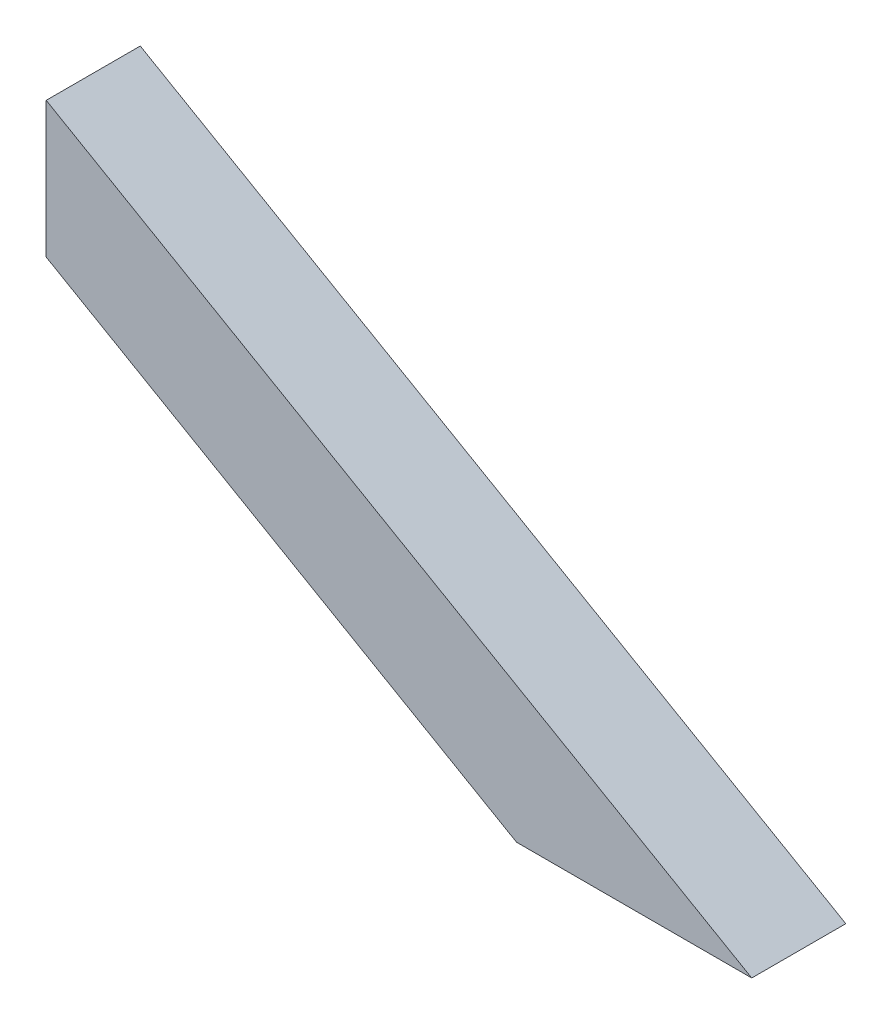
from build123d import *

# Parameters (mm, degrees)
LINEAR_AUSTRAGEN1_DEPTH = 20


with BuildPart() as part:
    # Skizze1 → Linear austragen1 (new body)
    with BuildSketch(Plane.XY):
        Polygon((0, 57.735026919), (0, 86.602540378), (150, 0), (100, 0), align=None)
    extrude(amount=LINEAR_AUSTRAGEN1_DEPTH)


solid = part.part
